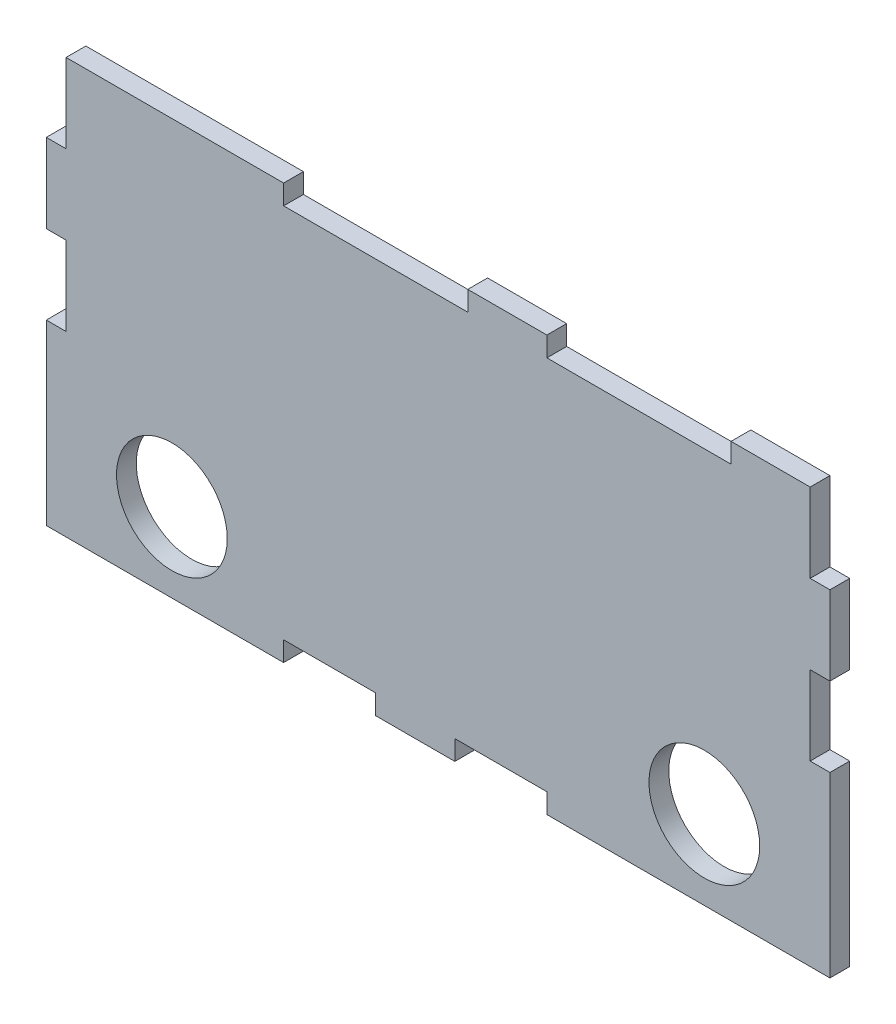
ISO-10303-21;
HEADER;
FILE_DESCRIPTION(('STEP AP214'),'2;1');
FILE_NAME('part.step','',(''),(''),'','','');
FILE_SCHEMA(('AUTOMOTIVE_DESIGN { 1 0 10303 214 1 1 1 1 }'));
ENDSEC;
DATA;
#1=APPLICATION_CONTEXT('core data for automotive mechanical design processes');
#2=APPLICATION_PROTOCOL_DEFINITION('international standard','automotive_design',2000,#1);
#3=PRODUCT_CONTEXT('',#1,'mechanical');
#4=PRODUCT('Part','Part','',(#3));
#5=PRODUCT_RELATED_PRODUCT_CATEGORY('part','',(#4));
#6=PRODUCT_DEFINITION_FORMATION('','',#4);
#7=PRODUCT_DEFINITION_CONTEXT('part definition',#1,'design');
#8=PRODUCT_DEFINITION('design','',#6,#7);
#9=PRODUCT_DEFINITION_SHAPE('','',#8);
#10=(LENGTH_UNIT() NAMED_UNIT(*) SI_UNIT(.MILLI.,.METRE.));
#11=(NAMED_UNIT(*) PLANE_ANGLE_UNIT() SI_UNIT($,.RADIAN.));
#12=(NAMED_UNIT(*) SI_UNIT($,.STERADIAN.) SOLID_ANGLE_UNIT());
#13=UNCERTAINTY_MEASURE_WITH_UNIT(LENGTH_MEASURE(1.E-05),#10,'distance_accuracy_value','');
#14=(GEOMETRIC_REPRESENTATION_CONTEXT(3) GLOBAL_UNCERTAINTY_ASSIGNED_CONTEXT((#13)) GLOBAL_UNIT_ASSIGNED_CONTEXT((#10,
#11,#12)) REPRESENTATION_CONTEXT('',''));
#15=CARTESIAN_POINT('',(0.,0.,0.));
#16=DIRECTION('',(0.,0.,1.));
#17=DIRECTION('',(1.,0.,0.));
#18=AXIS2_PLACEMENT_3D('',#15,#16,#17);
#19=CARTESIAN_POINT('',(0.,0.,5.));
#20=DIRECTION('',(0.,0.,1.));
#21=DIRECTION('',(1.,0.,0.));
#22=AXIS2_PLACEMENT_3D('',#19,#20,#21);
#23=PLANE('',#22);
#24=CARTESIAN_POINT('',(31.75,20.,5.));
#25=DIRECTION('',(0.,0.,1.));
#26=DIRECTION('',(1.,0.,0.));
#27=AXIS2_PLACEMENT_3D('',#24,#25,#26);
#28=CIRCLE('',#27,14.);
#29=CARTESIAN_POINT('',(45.75,20.,5.));
#30=VERTEX_POINT('',#29);
#31=EDGE_CURVE('E284',#30,#30,#28,.T.);
#32=ORIENTED_EDGE('',*,*,#31,.F.);
#33=EDGE_LOOP('',(#32));
#34=FACE_BOUND('',#33,.T.);
#35=DIRECTION('',(1.,0.,0.));
#36=VECTOR('',#35,1.);
#37=CARTESIAN_POINT('',(0.,0.,5.));
#38=LINE('',#37,#36);
#39=CARTESIAN_POINT('',(0.,0.,5.));
#40=VERTEX_POINT('',#39);
#41=CARTESIAN_POINT('',(60.,0.,5.));
#42=VERTEX_POINT('',#41);
#43=EDGE_CURVE('E343',#40,#42,#38,.T.);
#44=ORIENTED_EDGE('',*,*,#43,.T.);
#45=DIRECTION('',(0.,1.,0.));
#46=VECTOR('',#45,1.);
#47=CARTESIAN_POINT('',(60.,0.,5.));
#48=LINE('',#47,#46);
#49=CARTESIAN_POINT('',(60.,5.,5.));
#50=VERTEX_POINT('',#49);
#51=EDGE_CURVE('E171',#42,#50,#48,.T.);
#52=ORIENTED_EDGE('',*,*,#51,.T.);
#53=DIRECTION('',(1.,0.,0.));
#54=VECTOR('',#53,1.);
#55=CARTESIAN_POINT('',(60.,5.,5.));
#56=LINE('',#55,#54);
#57=CARTESIAN_POINT('',(83.28,5.,5.));
#58=VERTEX_POINT('',#57);
#59=EDGE_CURVE('E430',#50,#58,#56,.T.);
#60=ORIENTED_EDGE('',*,*,#59,.T.);
#61=DIRECTION('',(0.,-1.,0.));
#62=VECTOR('',#61,1.);
#63=CARTESIAN_POINT('',(83.28,5.,5.));
#64=LINE('',#63,#62);
#65=CARTESIAN_POINT('',(83.28,0.,5.));
#66=VERTEX_POINT('',#65);
#67=EDGE_CURVE('E449',#58,#66,#64,.T.);
#68=ORIENTED_EDGE('',*,*,#67,.T.);
#69=DIRECTION('',(1.,0.,0.));
#70=VECTOR('',#69,1.);
#71=CARTESIAN_POINT('',(83.28,0.,5.));
#72=LINE('',#71,#70);
#73=CARTESIAN_POINT('',(103.28,0.,5.));
#74=VERTEX_POINT('',#73);
#75=EDGE_CURVE('E446',#66,#74,#72,.T.);
#76=ORIENTED_EDGE('',*,*,#75,.T.);
#77=DIRECTION('',(0.,1.,0.));
#78=VECTOR('',#77,1.);
#79=CARTESIAN_POINT('',(103.28,0.,5.));
#80=LINE('',#79,#78);
#81=CARTESIAN_POINT('',(103.28,5.,5.));
#82=VERTEX_POINT('',#81);
#83=EDGE_CURVE('E448',#74,#82,#80,.T.);
#84=ORIENTED_EDGE('',*,*,#83,.T.);
#85=DIRECTION('',(1.,0.,0.));
#86=VECTOR('',#85,1.);
#87=CARTESIAN_POINT('',(103.28,5.,5.));
#88=LINE('',#87,#86);
#89=CARTESIAN_POINT('',(126.56,5.,5.));
#90=VERTEX_POINT('',#89);
#91=EDGE_CURVE('E451',#82,#90,#88,.T.);
#92=ORIENTED_EDGE('',*,*,#91,.T.);
#93=DIRECTION('',(0.,-1.,0.));
#94=VECTOR('',#93,1.);
#95=CARTESIAN_POINT('',(126.56,5.,5.));
#96=LINE('',#95,#94);
#97=CARTESIAN_POINT('',(126.56,0.,5.));
#98=VERTEX_POINT('',#97);
#99=EDGE_CURVE('E457',#90,#98,#96,.T.);
#100=ORIENTED_EDGE('',*,*,#99,.T.);
#101=DIRECTION('',(1.,0.,0.));
#102=VECTOR('',#101,1.);
#103=CARTESIAN_POINT('',(126.56,0.,5.));
#104=LINE('',#103,#102);
#105=CARTESIAN_POINT('',(198.12,0.,5.));
#106=VERTEX_POINT('',#105);
#107=EDGE_CURVE('E459',#98,#106,#104,.T.);
#108=ORIENTED_EDGE('',*,*,#107,.T.);
#109=DIRECTION('',(0.,1.,0.));
#110=VECTOR('',#109,1.);
#111=CARTESIAN_POINT('',(198.12,45.,5.));
#112=LINE('',#111,#110);
#113=CARTESIAN_POINT('',(198.12,45.,5.));
#114=VERTEX_POINT('',#113);
#115=EDGE_CURVE('E461',#106,#114,#112,.T.);
#116=ORIENTED_EDGE('',*,*,#115,.T.);
#117=DIRECTION('',(-1.,0.,0.));
#118=VECTOR('',#117,1.);
#119=CARTESIAN_POINT('',(193.12,45.,5.));
#120=LINE('',#119,#118);
#121=CARTESIAN_POINT('',(193.12,45.,5.));
#122=VERTEX_POINT('',#121);
#123=EDGE_CURVE('E463',#114,#122,#120,.T.);
#124=ORIENTED_EDGE('',*,*,#123,.T.);
#125=DIRECTION('',(0.,1.,0.));
#126=VECTOR('',#125,1.);
#127=CARTESIAN_POINT('',(193.12,65.,5.));
#128=LINE('',#127,#126);
#129=CARTESIAN_POINT('',(193.12,65.,5.));
#130=VERTEX_POINT('',#129);
#131=EDGE_CURVE('E465',#122,#130,#128,.T.);
#132=ORIENTED_EDGE('',*,*,#131,.T.);
#133=DIRECTION('',(1.,0.,0.));
#134=VECTOR('',#133,1.);
#135=CARTESIAN_POINT('',(198.12,65.,5.));
#136=LINE('',#135,#134);
#137=CARTESIAN_POINT('',(198.12,65.,5.));
#138=VERTEX_POINT('',#137);
#139=EDGE_CURVE('E467',#130,#138,#136,.T.);
#140=ORIENTED_EDGE('',*,*,#139,.T.);
#141=DIRECTION('',(0.,1.,0.));
#142=VECTOR('',#141,1.);
#143=CARTESIAN_POINT('',(198.12,85.,5.));
#144=LINE('',#143,#142);
#145=CARTESIAN_POINT('',(198.12,85.,5.));
#146=VERTEX_POINT('',#145);
#147=EDGE_CURVE('E469',#138,#146,#144,.T.);
#148=ORIENTED_EDGE('',*,*,#147,.T.);
#149=DIRECTION('',(-1.,0.,0.));
#150=VECTOR('',#149,1.);
#151=CARTESIAN_POINT('',(193.12,85.,5.));
#152=LINE('',#151,#150);
#153=CARTESIAN_POINT('',(193.12,85.,5.));
#154=VERTEX_POINT('',#153);
#155=EDGE_CURVE('E471',#146,#154,#152,.T.);
#156=ORIENTED_EDGE('',*,*,#155,.T.);
#157=DIRECTION('',(0.,1.,0.));
#158=VECTOR('',#157,1.);
#159=CARTESIAN_POINT('',(193.12,105.,5.));
#160=LINE('',#159,#158);
#161=CARTESIAN_POINT('',(193.12,105.,5.));
#162=VERTEX_POINT('',#161);
#163=EDGE_CURVE('E473',#154,#162,#160,.T.);
#164=ORIENTED_EDGE('',*,*,#163,.T.);
#165=DIRECTION('',(-1.,0.,0.));
#166=VECTOR('',#165,1.);
#167=CARTESIAN_POINT('',(173.12,105.,5.));
#168=LINE('',#167,#166);
#169=CARTESIAN_POINT('',(173.12,105.,5.));
#170=VERTEX_POINT('',#169);
#171=EDGE_CURVE('E475',#162,#170,#168,.T.);
#172=ORIENTED_EDGE('',*,*,#171,.T.);
#173=DIRECTION('',(0.,-1.,0.));
#174=VECTOR('',#173,1.);
#175=CARTESIAN_POINT('',(173.12,100.,5.));
#176=LINE('',#175,#174);
#177=CARTESIAN_POINT('',(173.12,100.,5.));
#178=VERTEX_POINT('',#177);
#179=EDGE_CURVE('E477',#170,#178,#176,.T.);
#180=ORIENTED_EDGE('',*,*,#179,.T.);
#181=DIRECTION('',(-1.,0.,0.));
#182=VECTOR('',#181,1.);
#183=CARTESIAN_POINT('',(126.56,100.,5.));
#184=LINE('',#183,#182);
#185=CARTESIAN_POINT('',(126.56,100.,5.));
#186=VERTEX_POINT('',#185);
#187=EDGE_CURVE('E479',#178,#186,#184,.T.);
#188=ORIENTED_EDGE('',*,*,#187,.T.);
#189=DIRECTION('',(0.,1.,0.));
#190=VECTOR('',#189,1.);
#191=CARTESIAN_POINT('',(126.56,105.,5.));
#192=LINE('',#191,#190);
#193=CARTESIAN_POINT('',(126.56,105.,5.));
#194=VERTEX_POINT('',#193);
#195=EDGE_CURVE('E481',#186,#194,#192,.T.);
#196=ORIENTED_EDGE('',*,*,#195,.T.);
#197=DIRECTION('',(-1.,0.,0.));
#198=VECTOR('',#197,1.);
#199=CARTESIAN_POINT('',(106.56,105.,5.));
#200=LINE('',#199,#198);
#201=CARTESIAN_POINT('',(106.56,105.,5.));
#202=VERTEX_POINT('',#201);
#203=EDGE_CURVE('E483',#194,#202,#200,.T.);
#204=ORIENTED_EDGE('',*,*,#203,.T.);
#205=DIRECTION('',(0.,-1.,0.));
#206=VECTOR('',#205,1.);
#207=CARTESIAN_POINT('',(106.56,100.,5.));
#208=LINE('',#207,#206);
#209=CARTESIAN_POINT('',(106.56,100.,5.));
#210=VERTEX_POINT('',#209);
#211=EDGE_CURVE('E485',#202,#210,#208,.T.);
#212=ORIENTED_EDGE('',*,*,#211,.T.);
#213=DIRECTION('',(-1.,0.,0.));
#214=VECTOR('',#213,1.);
#215=CARTESIAN_POINT('',(60.,100.,5.));
#216=LINE('',#215,#214);
#217=CARTESIAN_POINT('',(60.,100.,5.));
#218=VERTEX_POINT('',#217);
#219=EDGE_CURVE('E487',#210,#218,#216,.T.);
#220=ORIENTED_EDGE('',*,*,#219,.T.);
#221=DIRECTION('',(0.,1.,0.));
#222=VECTOR('',#221,1.);
#223=CARTESIAN_POINT('',(60.,105.,5.));
#224=LINE('',#223,#222);
#225=CARTESIAN_POINT('',(60.,105.,5.));
#226=VERTEX_POINT('',#225);
#227=EDGE_CURVE('E489',#218,#226,#224,.T.);
#228=ORIENTED_EDGE('',*,*,#227,.T.);
#229=DIRECTION('',(-1.,0.,0.));
#230=VECTOR('',#229,1.);
#231=CARTESIAN_POINT('',(5.,105.,5.));
#232=LINE('',#231,#230);
#233=CARTESIAN_POINT('',(5.,105.,5.));
#234=VERTEX_POINT('',#233);
#235=EDGE_CURVE('E491',#226,#234,#232,.T.);
#236=ORIENTED_EDGE('',*,*,#235,.T.);
#237=DIRECTION('',(0.,-1.,0.));
#238=VECTOR('',#237,1.);
#239=CARTESIAN_POINT('',(5.,85.,5.));
#240=LINE('',#239,#238);
#241=CARTESIAN_POINT('',(5.,85.,5.));
#242=VERTEX_POINT('',#241);
#243=EDGE_CURVE('E493',#234,#242,#240,.T.);
#244=ORIENTED_EDGE('',*,*,#243,.T.);
#245=DIRECTION('',(-1.,0.,0.));
#246=VECTOR('',#245,1.);
#247=CARTESIAN_POINT('',(0.,85.,5.));
#248=LINE('',#247,#246);
#249=CARTESIAN_POINT('',(0.,85.,5.));
#250=VERTEX_POINT('',#249);
#251=EDGE_CURVE('E495',#242,#250,#248,.T.);
#252=ORIENTED_EDGE('',*,*,#251,.T.);
#253=DIRECTION('',(0.,-1.,0.));
#254=VECTOR('',#253,1.);
#255=CARTESIAN_POINT('',(0.,65.,5.));
#256=LINE('',#255,#254);
#257=CARTESIAN_POINT('',(0.,65.,5.));
#258=VERTEX_POINT('',#257);
#259=EDGE_CURVE('E497',#250,#258,#256,.T.);
#260=ORIENTED_EDGE('',*,*,#259,.T.);
#261=DIRECTION('',(1.,0.,0.));
#262=VECTOR('',#261,1.);
#263=CARTESIAN_POINT('',(5.,65.,5.));
#264=LINE('',#263,#262);
#265=CARTESIAN_POINT('',(5.,65.,5.));
#266=VERTEX_POINT('',#265);
#267=EDGE_CURVE('E262',#258,#266,#264,.T.);
#268=ORIENTED_EDGE('',*,*,#267,.T.);
#269=DIRECTION('',(0.,-1.,0.));
#270=VECTOR('',#269,1.);
#271=CARTESIAN_POINT('',(5.,45.,5.));
#272=LINE('',#271,#270);
#273=CARTESIAN_POINT('',(5.,45.,5.));
#274=VERTEX_POINT('',#273);
#275=EDGE_CURVE('E256',#266,#274,#272,.T.);
#276=ORIENTED_EDGE('',*,*,#275,.T.);
#277=DIRECTION('',(-1.,0.,0.));
#278=VECTOR('',#277,1.);
#279=CARTESIAN_POINT('',(0.,45.,5.));
#280=LINE('',#279,#278);
#281=CARTESIAN_POINT('',(0.,45.,5.));
#282=VERTEX_POINT('',#281);
#283=EDGE_CURVE('E260',#274,#282,#280,.T.);
#284=ORIENTED_EDGE('',*,*,#283,.T.);
#285=DIRECTION('',(0.,-1.,0.));
#286=VECTOR('',#285,1.);
#287=CARTESIAN_POINT('',(0.,0.,5.));
#288=LINE('',#287,#286);
#289=EDGE_CURVE('E56',#282,#40,#288,.T.);
#290=ORIENTED_EDGE('',*,*,#289,.T.);
#291=EDGE_LOOP('',(#44,#52,#60,#68,#76,#84,#92,#100,#108,#116,#124,#132,#140,#148,#156,#164,
#172,#180,#188,#196,#204,#212,#220,#228,#236,#244,#252,#260,#268,#276,#284,#290));
#292=FACE_BOUND('',#291,.T.);
#293=CARTESIAN_POINT('',(166.37,20.,5.));
#294=DIRECTION('',(0.,0.,1.));
#295=DIRECTION('',(1.,0.,0.));
#296=AXIS2_PLACEMENT_3D('',#293,#294,#295);
#297=CIRCLE('',#296,14.);
#298=CARTESIAN_POINT('',(180.37,20.,5.));
#299=VERTEX_POINT('',#298);
#300=EDGE_CURVE('E539',#299,#299,#297,.T.);
#301=ORIENTED_EDGE('',*,*,#300,.F.);
#302=EDGE_LOOP('',(#301));
#303=FACE_BOUND('',#302,.T.);
#304=ADVANCED_FACE('F39',(#34,#292,#303),#23,.T.);
#305=CARTESIAN_POINT('',(0.,0.,0.));
#306=DIRECTION('',(0.,0.,1.));
#307=DIRECTION('',(1.,0.,0.));
#308=AXIS2_PLACEMENT_3D('',#305,#306,#307);
#309=PLANE('',#308);
#310=DIRECTION('',(1.,0.,0.));
#311=VECTOR('',#310,1.);
#312=CARTESIAN_POINT('',(0.,0.,0.));
#313=LINE('',#312,#311);
#314=CARTESIAN_POINT('',(0.,0.,0.));
#315=VERTEX_POINT('',#314);
#316=CARTESIAN_POINT('',(60.,0.,0.));
#317=VERTEX_POINT('',#316);
#318=EDGE_CURVE('E280',#315,#317,#313,.T.);
#319=ORIENTED_EDGE('',*,*,#318,.F.);
#320=DIRECTION('',(0.,-1.,0.));
#321=VECTOR('',#320,1.);
#322=CARTESIAN_POINT('',(0.,0.,0.));
#323=LINE('',#322,#321);
#324=CARTESIAN_POINT('',(0.,45.,0.));
#325=VERTEX_POINT('',#324);
#326=EDGE_CURVE('E163',#325,#315,#323,.T.);
#327=ORIENTED_EDGE('',*,*,#326,.F.);
#328=DIRECTION('',(-1.,0.,0.));
#329=VECTOR('',#328,1.);
#330=CARTESIAN_POINT('',(0.,45.,0.));
#331=LINE('',#330,#329);
#332=CARTESIAN_POINT('',(5.,45.,0.));
#333=VERTEX_POINT('',#332);
#334=EDGE_CURVE('E157',#333,#325,#331,.T.);
#335=ORIENTED_EDGE('',*,*,#334,.F.);
#336=DIRECTION('',(0.,-1.,0.));
#337=VECTOR('',#336,1.);
#338=CARTESIAN_POINT('',(5.,45.,0.));
#339=LINE('',#338,#337);
#340=CARTESIAN_POINT('',(5.,65.,0.));
#341=VERTEX_POINT('',#340);
#342=EDGE_CURVE('E270',#341,#333,#339,.T.);
#343=ORIENTED_EDGE('',*,*,#342,.F.);
#344=DIRECTION('',(1.,0.,0.));
#345=VECTOR('',#344,1.);
#346=CARTESIAN_POINT('',(5.,65.,0.));
#347=LINE('',#346,#345);
#348=CARTESIAN_POINT('',(0.,65.,0.));
#349=VERTEX_POINT('',#348);
#350=EDGE_CURVE('E338',#349,#341,#347,.T.);
#351=ORIENTED_EDGE('',*,*,#350,.F.);
#352=DIRECTION('',(0.,-1.,0.));
#353=VECTOR('',#352,1.);
#354=CARTESIAN_POINT('',(0.,65.,0.));
#355=LINE('',#354,#353);
#356=CARTESIAN_POINT('',(0.,85.,0.));
#357=VERTEX_POINT('',#356);
#358=EDGE_CURVE('E336',#357,#349,#355,.T.);
#359=ORIENTED_EDGE('',*,*,#358,.F.);
#360=DIRECTION('',(-1.,0.,0.));
#361=VECTOR('',#360,1.);
#362=CARTESIAN_POINT('',(0.,85.,0.));
#363=LINE('',#362,#361);
#364=CARTESIAN_POINT('',(5.,85.,0.));
#365=VERTEX_POINT('',#364);
#366=EDGE_CURVE('E334',#365,#357,#363,.T.);
#367=ORIENTED_EDGE('',*,*,#366,.F.);
#368=DIRECTION('',(0.,-1.,0.));
#369=VECTOR('',#368,1.);
#370=CARTESIAN_POINT('',(5.,85.,0.));
#371=LINE('',#370,#369);
#372=CARTESIAN_POINT('',(5.,105.,0.));
#373=VERTEX_POINT('',#372);
#374=EDGE_CURVE('E332',#373,#365,#371,.T.);
#375=ORIENTED_EDGE('',*,*,#374,.F.);
#376=DIRECTION('',(-1.,0.,0.));
#377=VECTOR('',#376,1.);
#378=CARTESIAN_POINT('',(5.,105.,0.));
#379=LINE('',#378,#377);
#380=CARTESIAN_POINT('',(60.,105.,0.));
#381=VERTEX_POINT('',#380);
#382=EDGE_CURVE('E330',#381,#373,#379,.T.);
#383=ORIENTED_EDGE('',*,*,#382,.F.);
#384=DIRECTION('',(0.,1.,0.));
#385=VECTOR('',#384,1.);
#386=CARTESIAN_POINT('',(60.,105.,0.));
#387=LINE('',#386,#385);
#388=CARTESIAN_POINT('',(60.,100.,0.));
#389=VERTEX_POINT('',#388);
#390=EDGE_CURVE('E328',#389,#381,#387,.T.);
#391=ORIENTED_EDGE('',*,*,#390,.F.);
#392=DIRECTION('',(-1.,0.,0.));
#393=VECTOR('',#392,1.);
#394=CARTESIAN_POINT('',(60.,100.,0.));
#395=LINE('',#394,#393);
#396=CARTESIAN_POINT('',(106.56,100.,0.));
#397=VERTEX_POINT('',#396);
#398=EDGE_CURVE('E326',#397,#389,#395,.T.);
#399=ORIENTED_EDGE('',*,*,#398,.F.);
#400=DIRECTION('',(0.,-1.,0.));
#401=VECTOR('',#400,1.);
#402=CARTESIAN_POINT('',(106.56,100.,0.));
#403=LINE('',#402,#401);
#404=CARTESIAN_POINT('',(106.56,105.,0.));
#405=VERTEX_POINT('',#404);
#406=EDGE_CURVE('E324',#405,#397,#403,.T.);
#407=ORIENTED_EDGE('',*,*,#406,.F.);
#408=DIRECTION('',(-1.,0.,0.));
#409=VECTOR('',#408,1.);
#410=CARTESIAN_POINT('',(106.56,105.,0.));
#411=LINE('',#410,#409);
#412=CARTESIAN_POINT('',(126.56,105.,0.));
#413=VERTEX_POINT('',#412);
#414=EDGE_CURVE('E322',#413,#405,#411,.T.);
#415=ORIENTED_EDGE('',*,*,#414,.F.);
#416=DIRECTION('',(0.,1.,0.));
#417=VECTOR('',#416,1.);
#418=CARTESIAN_POINT('',(126.56,105.,0.));
#419=LINE('',#418,#417);
#420=CARTESIAN_POINT('',(126.56,100.,0.));
#421=VERTEX_POINT('',#420);
#422=EDGE_CURVE('E320',#421,#413,#419,.T.);
#423=ORIENTED_EDGE('',*,*,#422,.F.);
#424=DIRECTION('',(-1.,0.,0.));
#425=VECTOR('',#424,1.);
#426=CARTESIAN_POINT('',(126.56,100.,0.));
#427=LINE('',#426,#425);
#428=CARTESIAN_POINT('',(173.12,100.,0.));
#429=VERTEX_POINT('',#428);
#430=EDGE_CURVE('E318',#429,#421,#427,.T.);
#431=ORIENTED_EDGE('',*,*,#430,.F.);
#432=DIRECTION('',(0.,-1.,0.));
#433=VECTOR('',#432,1.);
#434=CARTESIAN_POINT('',(173.12,100.,0.));
#435=LINE('',#434,#433);
#436=CARTESIAN_POINT('',(173.12,105.,0.));
#437=VERTEX_POINT('',#436);
#438=EDGE_CURVE('E316',#437,#429,#435,.T.);
#439=ORIENTED_EDGE('',*,*,#438,.F.);
#440=DIRECTION('',(-1.,0.,0.));
#441=VECTOR('',#440,1.);
#442=CARTESIAN_POINT('',(173.12,105.,0.));
#443=LINE('',#442,#441);
#444=CARTESIAN_POINT('',(193.12,105.,0.));
#445=VERTEX_POINT('',#444);
#446=EDGE_CURVE('E314',#445,#437,#443,.T.);
#447=ORIENTED_EDGE('',*,*,#446,.F.);
#448=DIRECTION('',(0.,1.,0.));
#449=VECTOR('',#448,1.);
#450=CARTESIAN_POINT('',(193.12,105.,0.));
#451=LINE('',#450,#449);
#452=CARTESIAN_POINT('',(193.12,85.,0.));
#453=VERTEX_POINT('',#452);
#454=EDGE_CURVE('E312',#453,#445,#451,.T.);
#455=ORIENTED_EDGE('',*,*,#454,.F.);
#456=DIRECTION('',(-1.,0.,0.));
#457=VECTOR('',#456,1.);
#458=CARTESIAN_POINT('',(193.12,85.,0.));
#459=LINE('',#458,#457);
#460=CARTESIAN_POINT('',(198.12,85.,0.));
#461=VERTEX_POINT('',#460);
#462=EDGE_CURVE('E310',#461,#453,#459,.T.);
#463=ORIENTED_EDGE('',*,*,#462,.F.);
#464=DIRECTION('',(0.,1.,0.));
#465=VECTOR('',#464,1.);
#466=CARTESIAN_POINT('',(198.12,85.,0.));
#467=LINE('',#466,#465);
#468=CARTESIAN_POINT('',(198.12,65.,0.));
#469=VERTEX_POINT('',#468);
#470=EDGE_CURVE('E308',#469,#461,#467,.T.);
#471=ORIENTED_EDGE('',*,*,#470,.F.);
#472=DIRECTION('',(1.,0.,0.));
#473=VECTOR('',#472,1.);
#474=CARTESIAN_POINT('',(198.12,65.,0.));
#475=LINE('',#474,#473);
#476=CARTESIAN_POINT('',(193.12,65.,0.));
#477=VERTEX_POINT('',#476);
#478=EDGE_CURVE('E306',#477,#469,#475,.T.);
#479=ORIENTED_EDGE('',*,*,#478,.F.);
#480=DIRECTION('',(0.,1.,0.));
#481=VECTOR('',#480,1.);
#482=CARTESIAN_POINT('',(193.12,65.,0.));
#483=LINE('',#482,#481);
#484=CARTESIAN_POINT('',(193.12,45.,0.));
#485=VERTEX_POINT('',#484);
#486=EDGE_CURVE('E304',#485,#477,#483,.T.);
#487=ORIENTED_EDGE('',*,*,#486,.F.);
#488=DIRECTION('',(-1.,0.,0.));
#489=VECTOR('',#488,1.);
#490=CARTESIAN_POINT('',(193.12,45.,0.));
#491=LINE('',#490,#489);
#492=CARTESIAN_POINT('',(198.12,45.,0.));
#493=VERTEX_POINT('',#492);
#494=EDGE_CURVE('E302',#493,#485,#491,.T.);
#495=ORIENTED_EDGE('',*,*,#494,.F.);
#496=DIRECTION('',(0.,1.,0.));
#497=VECTOR('',#496,1.);
#498=CARTESIAN_POINT('',(198.12,45.,0.));
#499=LINE('',#498,#497);
#500=CARTESIAN_POINT('',(198.12,0.,0.));
#501=VERTEX_POINT('',#500);
#502=EDGE_CURVE('E300',#501,#493,#499,.T.);
#503=ORIENTED_EDGE('',*,*,#502,.F.);
#504=DIRECTION('',(1.,0.,0.));
#505=VECTOR('',#504,1.);
#506=CARTESIAN_POINT('',(126.56,0.,0.));
#507=LINE('',#506,#505);
#508=CARTESIAN_POINT('',(126.56,0.,0.));
#509=VERTEX_POINT('',#508);
#510=EDGE_CURVE('E298',#509,#501,#507,.T.);
#511=ORIENTED_EDGE('',*,*,#510,.F.);
#512=DIRECTION('',(0.,-1.,0.));
#513=VECTOR('',#512,1.);
#514=CARTESIAN_POINT('',(126.56,5.,0.));
#515=LINE('',#514,#513);
#516=CARTESIAN_POINT('',(126.56,5.,0.));
#517=VERTEX_POINT('',#516);
#518=EDGE_CURVE('E296',#517,#509,#515,.T.);
#519=ORIENTED_EDGE('',*,*,#518,.F.);
#520=DIRECTION('',(1.,0.,0.));
#521=VECTOR('',#520,1.);
#522=CARTESIAN_POINT('',(103.28,5.,0.));
#523=LINE('',#522,#521);
#524=CARTESIAN_POINT('',(103.28,5.,0.));
#525=VERTEX_POINT('',#524);
#526=EDGE_CURVE('E294',#525,#517,#523,.T.);
#527=ORIENTED_EDGE('',*,*,#526,.F.);
#528=DIRECTION('',(0.,1.,0.));
#529=VECTOR('',#528,1.);
#530=CARTESIAN_POINT('',(103.28,0.,0.));
#531=LINE('',#530,#529);
#532=CARTESIAN_POINT('',(103.28,0.,0.));
#533=VERTEX_POINT('',#532);
#534=EDGE_CURVE('E292',#533,#525,#531,.T.);
#535=ORIENTED_EDGE('',*,*,#534,.F.);
#536=DIRECTION('',(1.,0.,0.));
#537=VECTOR('',#536,1.);
#538=CARTESIAN_POINT('',(83.28,0.,0.));
#539=LINE('',#538,#537);
#540=CARTESIAN_POINT('',(83.28,0.,0.));
#541=VERTEX_POINT('',#540);
#542=EDGE_CURVE('E290',#541,#533,#539,.T.);
#543=ORIENTED_EDGE('',*,*,#542,.F.);
#544=DIRECTION('',(0.,-1.,0.));
#545=VECTOR('',#544,1.);
#546=CARTESIAN_POINT('',(83.28,5.,0.));
#547=LINE('',#546,#545);
#548=CARTESIAN_POINT('',(83.28,5.,0.));
#549=VERTEX_POINT('',#548);
#550=EDGE_CURVE('E288',#549,#541,#547,.T.);
#551=ORIENTED_EDGE('',*,*,#550,.F.);
#552=DIRECTION('',(1.,0.,0.));
#553=VECTOR('',#552,1.);
#554=CARTESIAN_POINT('',(60.,5.,0.));
#555=LINE('',#554,#553);
#556=CARTESIAN_POINT('',(60.,5.,0.));
#557=VERTEX_POINT('',#556);
#558=EDGE_CURVE('E286',#557,#549,#555,.T.);
#559=ORIENTED_EDGE('',*,*,#558,.F.);
#560=DIRECTION('',(0.,1.,0.));
#561=VECTOR('',#560,1.);
#562=CARTESIAN_POINT('',(60.,0.,0.));
#563=LINE('',#562,#561);
#564=EDGE_CURVE('E283',#317,#557,#563,.T.);
#565=ORIENTED_EDGE('',*,*,#564,.F.);
#566=EDGE_LOOP('',(#319,#327,#335,#343,#351,#359,#367,#375,#383,#391,#399,#407,#415,#423,#431,
#439,#447,#455,#463,#471,#479,#487,#495,#503,#511,#519,#527,#535,#543,#551,#559,#565));
#567=FACE_BOUND('',#566,.T.);
#568=CARTESIAN_POINT('',(31.75,20.,0.));
#569=DIRECTION('',(0.,0.,1.));
#570=DIRECTION('',(1.,0.,0.));
#571=AXIS2_PLACEMENT_3D('',#568,#569,#570);
#572=CIRCLE('',#571,14.);
#573=CARTESIAN_POINT('',(45.75,20.,0.));
#574=VERTEX_POINT('',#573);
#575=EDGE_CURVE('E545',#574,#574,#572,.T.);
#576=ORIENTED_EDGE('',*,*,#575,.T.);
#577=EDGE_LOOP('',(#576));
#578=FACE_BOUND('',#577,.T.);
#579=CARTESIAN_POINT('',(166.37,20.,0.));
#580=DIRECTION('',(0.,0.,1.));
#581=DIRECTION('',(1.,0.,0.));
#582=AXIS2_PLACEMENT_3D('',#579,#580,#581);
#583=CIRCLE('',#582,14.);
#584=CARTESIAN_POINT('',(180.37,20.,0.));
#585=VERTEX_POINT('',#584);
#586=EDGE_CURVE('E542',#585,#585,#583,.T.);
#587=ORIENTED_EDGE('',*,*,#586,.T.);
#588=EDGE_LOOP('',(#587));
#589=FACE_BOUND('',#588,.T.);
#590=ADVANCED_FACE('F434',(#567,#578,#589),#309,.F.);
#591=CARTESIAN_POINT('',(0.,0.,5.));
#592=DIRECTION('',(0.,1.,0.));
#593=DIRECTION('',(0.,0.,1.));
#594=AXIS2_PLACEMENT_3D('',#591,#592,#593);
#595=PLANE('',#594);
#596=ORIENTED_EDGE('',*,*,#318,.T.);
#597=DIRECTION('',(0.,0.,-1.));
#598=VECTOR('',#597,1.);
#599=CARTESIAN_POINT('',(60.,0.,5.));
#600=LINE('',#599,#598);
#601=EDGE_CURVE('E11',#42,#317,#600,.T.);
#602=ORIENTED_EDGE('',*,*,#601,.F.);
#603=ORIENTED_EDGE('',*,*,#43,.F.);
#604=DIRECTION('',(0.,0.,-1.));
#605=VECTOR('',#604,1.);
#606=CARTESIAN_POINT('',(0.,0.,5.));
#607=LINE('',#606,#605);
#608=EDGE_CURVE('E276',#40,#315,#607,.T.);
#609=ORIENTED_EDGE('',*,*,#608,.T.);
#610=EDGE_LOOP('',(#596,#602,#603,#609));
#611=FACE_BOUND('',#610,.T.);
#612=ADVANCED_FACE('F41',(#611),#595,.F.);
#613=CARTESIAN_POINT('',(60.,0.,5.));
#614=DIRECTION('',(-1.,0.,0.));
#615=DIRECTION('',(0.,0.,1.));
#616=AXIS2_PLACEMENT_3D('',#613,#614,#615);
#617=PLANE('',#616);
#618=ORIENTED_EDGE('',*,*,#564,.T.);
#619=DIRECTION('',(0.,0.,-1.));
#620=VECTOR('',#619,1.);
#621=CARTESIAN_POINT('',(60.,5.,5.));
#622=LINE('',#621,#620);
#623=EDGE_CURVE('E48',#50,#557,#622,.T.);
#624=ORIENTED_EDGE('',*,*,#623,.F.);
#625=ORIENTED_EDGE('',*,*,#51,.F.);
#626=ORIENTED_EDGE('',*,*,#601,.T.);
#627=EDGE_LOOP('',(#618,#624,#625,#626));
#628=FACE_BOUND('',#627,.T.);
#629=ADVANCED_FACE('F868',(#628),#617,.F.);
#630=CARTESIAN_POINT('',(60.,5.,5.));
#631=DIRECTION('',(0.,1.,0.));
#632=DIRECTION('',(0.,0.,1.));
#633=AXIS2_PLACEMENT_3D('',#630,#631,#632);
#634=PLANE('',#633);
#635=ORIENTED_EDGE('',*,*,#558,.T.);
#636=DIRECTION('',(0.,0.,-1.));
#637=VECTOR('',#636,1.);
#638=CARTESIAN_POINT('',(83.28,5.,5.));
#639=LINE('',#638,#637);
#640=EDGE_CURVE('E422',#58,#549,#639,.T.);
#641=ORIENTED_EDGE('',*,*,#640,.F.);
#642=ORIENTED_EDGE('',*,*,#59,.F.);
#643=ORIENTED_EDGE('',*,*,#623,.T.);
#644=EDGE_LOOP('',(#635,#641,#642,#643));
#645=FACE_BOUND('',#644,.T.);
#646=ADVANCED_FACE('F428',(#645),#634,.F.);
#647=CARTESIAN_POINT('',(83.28,5.,5.));
#648=DIRECTION('',(1.,0.,0.));
#649=DIRECTION('',(0.,0.,-1.));
#650=AXIS2_PLACEMENT_3D('',#647,#648,#649);
#651=PLANE('',#650);
#652=ORIENTED_EDGE('',*,*,#550,.T.);
#653=DIRECTION('',(0.,0.,-1.));
#654=VECTOR('',#653,1.);
#655=CARTESIAN_POINT('',(83.28,0.,5.));
#656=LINE('',#655,#654);
#657=EDGE_CURVE('E419',#66,#541,#656,.T.);
#658=ORIENTED_EDGE('',*,*,#657,.F.);
#659=ORIENTED_EDGE('',*,*,#67,.F.);
#660=ORIENTED_EDGE('',*,*,#640,.T.);
#661=EDGE_LOOP('',(#652,#658,#659,#660));
#662=FACE_BOUND('',#661,.T.);
#663=ADVANCED_FACE('F440',(#662),#651,.F.);
#664=CARTESIAN_POINT('',(83.28,0.,5.));
#665=DIRECTION('',(0.,1.,0.));
#666=DIRECTION('',(0.,0.,1.));
#667=AXIS2_PLACEMENT_3D('',#664,#665,#666);
#668=PLANE('',#667);
#669=ORIENTED_EDGE('',*,*,#542,.T.);
#670=DIRECTION('',(0.,0.,-1.));
#671=VECTOR('',#670,1.);
#672=CARTESIAN_POINT('',(103.28,0.,5.));
#673=LINE('',#672,#671);
#674=EDGE_CURVE('E416',#74,#533,#673,.T.);
#675=ORIENTED_EDGE('',*,*,#674,.F.);
#676=ORIENTED_EDGE('',*,*,#75,.F.);
#677=ORIENTED_EDGE('',*,*,#657,.T.);
#678=EDGE_LOOP('',(#669,#675,#676,#677));
#679=FACE_BOUND('',#678,.T.);
#680=ADVANCED_FACE('F444',(#679),#668,.F.);
#681=CARTESIAN_POINT('',(103.28,0.,5.));
#682=DIRECTION('',(-1.,0.,0.));
#683=DIRECTION('',(0.,0.,1.));
#684=AXIS2_PLACEMENT_3D('',#681,#682,#683);
#685=PLANE('',#684);
#686=ORIENTED_EDGE('',*,*,#534,.T.);
#687=DIRECTION('',(0.,0.,-1.));
#688=VECTOR('',#687,1.);
#689=CARTESIAN_POINT('',(103.28,5.,5.));
#690=LINE('',#689,#688);
#691=EDGE_CURVE('E413',#82,#525,#690,.T.);
#692=ORIENTED_EDGE('',*,*,#691,.F.);
#693=ORIENTED_EDGE('',*,*,#83,.F.);
#694=ORIENTED_EDGE('',*,*,#674,.T.);
#695=EDGE_LOOP('',(#686,#692,#693,#694));
#696=FACE_BOUND('',#695,.T.);
#697=ADVANCED_FACE('F829',(#696),#685,.F.);
#698=CARTESIAN_POINT('',(103.28,5.,5.));
#699=DIRECTION('',(0.,1.,0.));
#700=DIRECTION('',(0.,0.,1.));
#701=AXIS2_PLACEMENT_3D('',#698,#699,#700);
#702=PLANE('',#701);
#703=ORIENTED_EDGE('',*,*,#526,.T.);
#704=DIRECTION('',(0.,0.,-1.));
#705=VECTOR('',#704,1.);
#706=CARTESIAN_POINT('',(126.56,5.,5.));
#707=LINE('',#706,#705);
#708=EDGE_CURVE('E410',#90,#517,#707,.T.);
#709=ORIENTED_EDGE('',*,*,#708,.F.);
#710=ORIENTED_EDGE('',*,*,#91,.F.);
#711=ORIENTED_EDGE('',*,*,#691,.T.);
#712=EDGE_LOOP('',(#703,#709,#710,#711));
#713=FACE_BOUND('',#712,.T.);
#714=ADVANCED_FACE('F818',(#713),#702,.F.);
#715=CARTESIAN_POINT('',(126.56,5.,5.));
#716=DIRECTION('',(1.,0.,0.));
#717=DIRECTION('',(0.,0.,-1.));
#718=AXIS2_PLACEMENT_3D('',#715,#716,#717);
#719=PLANE('',#718);
#720=ORIENTED_EDGE('',*,*,#518,.T.);
#721=DIRECTION('',(0.,0.,-1.));
#722=VECTOR('',#721,1.);
#723=CARTESIAN_POINT('',(126.56,0.,5.));
#724=LINE('',#723,#722);
#725=EDGE_CURVE('E407',#98,#509,#724,.T.);
#726=ORIENTED_EDGE('',*,*,#725,.F.);
#727=ORIENTED_EDGE('',*,*,#99,.F.);
#728=ORIENTED_EDGE('',*,*,#708,.T.);
#729=EDGE_LOOP('',(#720,#726,#727,#728));
#730=FACE_BOUND('',#729,.T.);
#731=ADVANCED_FACE('F807',(#730),#719,.F.);
#732=CARTESIAN_POINT('',(126.56,0.,5.));
#733=DIRECTION('',(0.,1.,0.));
#734=DIRECTION('',(0.,0.,1.));
#735=AXIS2_PLACEMENT_3D('',#732,#733,#734);
#736=PLANE('',#735);
#737=ORIENTED_EDGE('',*,*,#510,.T.);
#738=DIRECTION('',(0.,0.,-1.));
#739=VECTOR('',#738,1.);
#740=CARTESIAN_POINT('',(198.12,0.,5.));
#741=LINE('',#740,#739);
#742=EDGE_CURVE('E404',#106,#501,#741,.T.);
#743=ORIENTED_EDGE('',*,*,#742,.F.);
#744=ORIENTED_EDGE('',*,*,#107,.F.);
#745=ORIENTED_EDGE('',*,*,#725,.T.);
#746=EDGE_LOOP('',(#737,#743,#744,#745));
#747=FACE_BOUND('',#746,.T.);
#748=ADVANCED_FACE('F796',(#747),#736,.F.);
#749=CARTESIAN_POINT('',(198.12,45.,5.));
#750=DIRECTION('',(-1.,0.,0.));
#751=DIRECTION('',(0.,0.,1.));
#752=AXIS2_PLACEMENT_3D('',#749,#750,#751);
#753=PLANE('',#752);
#754=ORIENTED_EDGE('',*,*,#502,.T.);
#755=DIRECTION('',(0.,0.,-1.));
#756=VECTOR('',#755,1.);
#757=CARTESIAN_POINT('',(198.12,45.,5.));
#758=LINE('',#757,#756);
#759=EDGE_CURVE('E401',#114,#493,#758,.T.);
#760=ORIENTED_EDGE('',*,*,#759,.F.);
#761=ORIENTED_EDGE('',*,*,#115,.F.);
#762=ORIENTED_EDGE('',*,*,#742,.T.);
#763=EDGE_LOOP('',(#754,#760,#761,#762));
#764=FACE_BOUND('',#763,.T.);
#765=ADVANCED_FACE('F785',(#764),#753,.F.);
#766=CARTESIAN_POINT('',(193.12,45.,5.));
#767=DIRECTION('',(0.,-1.,0.));
#768=DIRECTION('',(0.,0.,-1.));
#769=AXIS2_PLACEMENT_3D('',#766,#767,#768);
#770=PLANE('',#769);
#771=ORIENTED_EDGE('',*,*,#494,.T.);
#772=DIRECTION('',(0.,0.,-1.));
#773=VECTOR('',#772,1.);
#774=CARTESIAN_POINT('',(193.12,45.,5.));
#775=LINE('',#774,#773);
#776=EDGE_CURVE('E398',#122,#485,#775,.T.);
#777=ORIENTED_EDGE('',*,*,#776,.F.);
#778=ORIENTED_EDGE('',*,*,#123,.F.);
#779=ORIENTED_EDGE('',*,*,#759,.T.);
#780=EDGE_LOOP('',(#771,#777,#778,#779));
#781=FACE_BOUND('',#780,.T.);
#782=ADVANCED_FACE('F774',(#781),#770,.F.);
#783=CARTESIAN_POINT('',(193.12,65.,5.));
#784=DIRECTION('',(-1.,0.,0.));
#785=DIRECTION('',(0.,0.,1.));
#786=AXIS2_PLACEMENT_3D('',#783,#784,#785);
#787=PLANE('',#786);
#788=ORIENTED_EDGE('',*,*,#486,.T.);
#789=DIRECTION('',(0.,0.,-1.));
#790=VECTOR('',#789,1.);
#791=CARTESIAN_POINT('',(193.12,65.,5.));
#792=LINE('',#791,#790);
#793=EDGE_CURVE('E395',#130,#477,#792,.T.);
#794=ORIENTED_EDGE('',*,*,#793,.F.);
#795=ORIENTED_EDGE('',*,*,#131,.F.);
#796=ORIENTED_EDGE('',*,*,#776,.T.);
#797=EDGE_LOOP('',(#788,#794,#795,#796));
#798=FACE_BOUND('',#797,.T.);
#799=ADVANCED_FACE('F763',(#798),#787,.F.);
#800=CARTESIAN_POINT('',(198.12,65.,5.));
#801=DIRECTION('',(0.,1.,0.));
#802=DIRECTION('',(0.,0.,1.));
#803=AXIS2_PLACEMENT_3D('',#800,#801,#802);
#804=PLANE('',#803);
#805=ORIENTED_EDGE('',*,*,#478,.T.);
#806=DIRECTION('',(0.,0.,-1.));
#807=VECTOR('',#806,1.);
#808=CARTESIAN_POINT('',(198.12,65.,5.));
#809=LINE('',#808,#807);
#810=EDGE_CURVE('E392',#138,#469,#809,.T.);
#811=ORIENTED_EDGE('',*,*,#810,.F.);
#812=ORIENTED_EDGE('',*,*,#139,.F.);
#813=ORIENTED_EDGE('',*,*,#793,.T.);
#814=EDGE_LOOP('',(#805,#811,#812,#813));
#815=FACE_BOUND('',#814,.T.);
#816=ADVANCED_FACE('F752',(#815),#804,.F.);
#817=CARTESIAN_POINT('',(198.12,85.,5.));
#818=DIRECTION('',(-1.,0.,0.));
#819=DIRECTION('',(0.,0.,1.));
#820=AXIS2_PLACEMENT_3D('',#817,#818,#819);
#821=PLANE('',#820);
#822=ORIENTED_EDGE('',*,*,#470,.T.);
#823=DIRECTION('',(0.,0.,-1.));
#824=VECTOR('',#823,1.);
#825=CARTESIAN_POINT('',(198.12,85.,5.));
#826=LINE('',#825,#824);
#827=EDGE_CURVE('E389',#146,#461,#826,.T.);
#828=ORIENTED_EDGE('',*,*,#827,.F.);
#829=ORIENTED_EDGE('',*,*,#147,.F.);
#830=ORIENTED_EDGE('',*,*,#810,.T.);
#831=EDGE_LOOP('',(#822,#828,#829,#830));
#832=FACE_BOUND('',#831,.T.);
#833=ADVANCED_FACE('F741',(#832),#821,.F.);
#834=CARTESIAN_POINT('',(193.12,85.,5.));
#835=DIRECTION('',(0.,-1.,0.));
#836=DIRECTION('',(0.,0.,-1.));
#837=AXIS2_PLACEMENT_3D('',#834,#835,#836);
#838=PLANE('',#837);
#839=ORIENTED_EDGE('',*,*,#462,.T.);
#840=DIRECTION('',(0.,0.,-1.));
#841=VECTOR('',#840,1.);
#842=CARTESIAN_POINT('',(193.12,85.,5.));
#843=LINE('',#842,#841);
#844=EDGE_CURVE('E386',#154,#453,#843,.T.);
#845=ORIENTED_EDGE('',*,*,#844,.F.);
#846=ORIENTED_EDGE('',*,*,#155,.F.);
#847=ORIENTED_EDGE('',*,*,#827,.T.);
#848=EDGE_LOOP('',(#839,#845,#846,#847));
#849=FACE_BOUND('',#848,.T.);
#850=ADVANCED_FACE('F730',(#849),#838,.F.);
#851=CARTESIAN_POINT('',(193.12,105.,5.));
#852=DIRECTION('',(-1.,0.,0.));
#853=DIRECTION('',(0.,0.,1.));
#854=AXIS2_PLACEMENT_3D('',#851,#852,#853);
#855=PLANE('',#854);
#856=ORIENTED_EDGE('',*,*,#454,.T.);
#857=DIRECTION('',(0.,0.,-1.));
#858=VECTOR('',#857,1.);
#859=CARTESIAN_POINT('',(193.12,105.,5.));
#860=LINE('',#859,#858);
#861=EDGE_CURVE('E383',#162,#445,#860,.T.);
#862=ORIENTED_EDGE('',*,*,#861,.F.);
#863=ORIENTED_EDGE('',*,*,#163,.F.);
#864=ORIENTED_EDGE('',*,*,#844,.T.);
#865=EDGE_LOOP('',(#856,#862,#863,#864));
#866=FACE_BOUND('',#865,.T.);
#867=ADVANCED_FACE('F719',(#866),#855,.F.);
#868=CARTESIAN_POINT('',(173.12,105.,5.));
#869=DIRECTION('',(0.,-1.,0.));
#870=DIRECTION('',(0.,0.,-1.));
#871=AXIS2_PLACEMENT_3D('',#868,#869,#870);
#872=PLANE('',#871);
#873=ORIENTED_EDGE('',*,*,#446,.T.);
#874=DIRECTION('',(0.,0.,-1.));
#875=VECTOR('',#874,1.);
#876=CARTESIAN_POINT('',(173.12,105.,5.));
#877=LINE('',#876,#875);
#878=EDGE_CURVE('E380',#170,#437,#877,.T.);
#879=ORIENTED_EDGE('',*,*,#878,.F.);
#880=ORIENTED_EDGE('',*,*,#171,.F.);
#881=ORIENTED_EDGE('',*,*,#861,.T.);
#882=EDGE_LOOP('',(#873,#879,#880,#881));
#883=FACE_BOUND('',#882,.T.);
#884=ADVANCED_FACE('F708',(#883),#872,.F.);
#885=CARTESIAN_POINT('',(173.12,100.,5.));
#886=DIRECTION('',(1.,0.,0.));
#887=DIRECTION('',(0.,1.,0.));
#888=AXIS2_PLACEMENT_3D('',#885,#886,#887);
#889=PLANE('',#888);
#890=ORIENTED_EDGE('',*,*,#438,.T.);
#891=DIRECTION('',(0.,0.,-1.));
#892=VECTOR('',#891,1.);
#893=CARTESIAN_POINT('',(173.12,100.,5.));
#894=LINE('',#893,#892);
#895=EDGE_CURVE('E377',#178,#429,#894,.T.);
#896=ORIENTED_EDGE('',*,*,#895,.F.);
#897=ORIENTED_EDGE('',*,*,#179,.F.);
#898=ORIENTED_EDGE('',*,*,#878,.T.);
#899=EDGE_LOOP('',(#890,#896,#897,#898));
#900=FACE_BOUND('',#899,.T.);
#901=ADVANCED_FACE('F697',(#900),#889,.F.);
#902=CARTESIAN_POINT('',(126.56,100.,5.));
#903=DIRECTION('',(0.,-1.,0.));
#904=DIRECTION('',(0.,0.,-1.));
#905=AXIS2_PLACEMENT_3D('',#902,#903,#904);
#906=PLANE('',#905);
#907=ORIENTED_EDGE('',*,*,#430,.T.);
#908=DIRECTION('',(0.,0.,-1.));
#909=VECTOR('',#908,1.);
#910=CARTESIAN_POINT('',(126.56,100.,5.));
#911=LINE('',#910,#909);
#912=EDGE_CURVE('E374',#186,#421,#911,.T.);
#913=ORIENTED_EDGE('',*,*,#912,.F.);
#914=ORIENTED_EDGE('',*,*,#187,.F.);
#915=ORIENTED_EDGE('',*,*,#895,.T.);
#916=EDGE_LOOP('',(#907,#913,#914,#915));
#917=FACE_BOUND('',#916,.T.);
#918=ADVANCED_FACE('F686',(#917),#906,.F.);
#919=CARTESIAN_POINT('',(126.56,105.,5.));
#920=DIRECTION('',(-1.,0.,0.));
#921=DIRECTION('',(0.,0.,1.));
#922=AXIS2_PLACEMENT_3D('',#919,#920,#921);
#923=PLANE('',#922);
#924=ORIENTED_EDGE('',*,*,#422,.T.);
#925=DIRECTION('',(0.,0.,-1.));
#926=VECTOR('',#925,1.);
#927=CARTESIAN_POINT('',(126.56,105.,5.));
#928=LINE('',#927,#926);
#929=EDGE_CURVE('E371',#194,#413,#928,.T.);
#930=ORIENTED_EDGE('',*,*,#929,.F.);
#931=ORIENTED_EDGE('',*,*,#195,.F.);
#932=ORIENTED_EDGE('',*,*,#912,.T.);
#933=EDGE_LOOP('',(#924,#930,#931,#932));
#934=FACE_BOUND('',#933,.T.);
#935=ADVANCED_FACE('F675',(#934),#923,.F.);
#936=CARTESIAN_POINT('',(106.56,105.,5.));
#937=DIRECTION('',(0.,-1.,0.));
#938=DIRECTION('',(0.,0.,-1.));
#939=AXIS2_PLACEMENT_3D('',#936,#937,#938);
#940=PLANE('',#939);
#941=ORIENTED_EDGE('',*,*,#414,.T.);
#942=DIRECTION('',(0.,0.,-1.));
#943=VECTOR('',#942,1.);
#944=CARTESIAN_POINT('',(106.56,105.,5.));
#945=LINE('',#944,#943);
#946=EDGE_CURVE('E368',#202,#405,#945,.T.);
#947=ORIENTED_EDGE('',*,*,#946,.F.);
#948=ORIENTED_EDGE('',*,*,#203,.F.);
#949=ORIENTED_EDGE('',*,*,#929,.T.);
#950=EDGE_LOOP('',(#941,#947,#948,#949));
#951=FACE_BOUND('',#950,.T.);
#952=ADVANCED_FACE('F664',(#951),#940,.F.);
#953=CARTESIAN_POINT('',(106.56,100.,5.));
#954=DIRECTION('',(1.,0.,0.));
#955=DIRECTION('',(0.,0.,-1.));
#956=AXIS2_PLACEMENT_3D('',#953,#954,#955);
#957=PLANE('',#956);
#958=ORIENTED_EDGE('',*,*,#406,.T.);
#959=DIRECTION('',(0.,0.,-1.));
#960=VECTOR('',#959,1.);
#961=CARTESIAN_POINT('',(106.56,100.,5.));
#962=LINE('',#961,#960);
#963=EDGE_CURVE('E365',#210,#397,#962,.T.);
#964=ORIENTED_EDGE('',*,*,#963,.F.);
#965=ORIENTED_EDGE('',*,*,#211,.F.);
#966=ORIENTED_EDGE('',*,*,#946,.T.);
#967=EDGE_LOOP('',(#958,#964,#965,#966));
#968=FACE_BOUND('',#967,.T.);
#969=ADVANCED_FACE('F653',(#968),#957,.F.);
#970=CARTESIAN_POINT('',(60.,100.,5.));
#971=DIRECTION('',(0.,-1.,0.));
#972=DIRECTION('',(0.,0.,-1.));
#973=AXIS2_PLACEMENT_3D('',#970,#971,#972);
#974=PLANE('',#973);
#975=ORIENTED_EDGE('',*,*,#398,.T.);
#976=DIRECTION('',(0.,0.,-1.));
#977=VECTOR('',#976,1.);
#978=CARTESIAN_POINT('',(60.,100.,5.));
#979=LINE('',#978,#977);
#980=EDGE_CURVE('E362',#218,#389,#979,.T.);
#981=ORIENTED_EDGE('',*,*,#980,.F.);
#982=ORIENTED_EDGE('',*,*,#219,.F.);
#983=ORIENTED_EDGE('',*,*,#963,.T.);
#984=EDGE_LOOP('',(#975,#981,#982,#983));
#985=FACE_BOUND('',#984,.T.);
#986=ADVANCED_FACE('F642',(#985),#974,.F.);
#987=CARTESIAN_POINT('',(60.,105.,5.));
#988=DIRECTION('',(-1.,0.,0.));
#989=DIRECTION('',(0.,0.,1.));
#990=AXIS2_PLACEMENT_3D('',#987,#988,#989);
#991=PLANE('',#990);
#992=ORIENTED_EDGE('',*,*,#390,.T.);
#993=DIRECTION('',(0.,0.,-1.));
#994=VECTOR('',#993,1.);
#995=CARTESIAN_POINT('',(60.,105.,5.));
#996=LINE('',#995,#994);
#997=EDGE_CURVE('E359',#226,#381,#996,.T.);
#998=ORIENTED_EDGE('',*,*,#997,.F.);
#999=ORIENTED_EDGE('',*,*,#227,.F.);
#1000=ORIENTED_EDGE('',*,*,#980,.T.);
#1001=EDGE_LOOP('',(#992,#998,#999,#1000));
#1002=FACE_BOUND('',#1001,.T.);
#1003=ADVANCED_FACE('F631',(#1002),#991,.F.);
#1004=CARTESIAN_POINT('',(5.,105.,5.));
#1005=DIRECTION('',(0.,-1.,0.));
#1006=DIRECTION('',(0.,0.,-1.));
#1007=AXIS2_PLACEMENT_3D('',#1004,#1005,#1006);
#1008=PLANE('',#1007);
#1009=ORIENTED_EDGE('',*,*,#382,.T.);
#1010=DIRECTION('',(0.,0.,-1.));
#1011=VECTOR('',#1010,1.);
#1012=CARTESIAN_POINT('',(5.,105.,5.));
#1013=LINE('',#1012,#1011);
#1014=EDGE_CURVE('E356',#234,#373,#1013,.T.);
#1015=ORIENTED_EDGE('',*,*,#1014,.F.);
#1016=ORIENTED_EDGE('',*,*,#235,.F.);
#1017=ORIENTED_EDGE('',*,*,#997,.T.);
#1018=EDGE_LOOP('',(#1009,#1015,#1016,#1017));
#1019=FACE_BOUND('',#1018,.T.);
#1020=ADVANCED_FACE('F620',(#1019),#1008,.F.);
#1021=CARTESIAN_POINT('',(5.,85.,5.));
#1022=DIRECTION('',(1.,0.,0.));
#1023=DIRECTION('',(0.,0.,-1.));
#1024=AXIS2_PLACEMENT_3D('',#1021,#1022,#1023);
#1025=PLANE('',#1024);
#1026=ORIENTED_EDGE('',*,*,#374,.T.);
#1027=DIRECTION('',(0.,0.,-1.));
#1028=VECTOR('',#1027,1.);
#1029=CARTESIAN_POINT('',(5.,85.,5.));
#1030=LINE('',#1029,#1028);
#1031=EDGE_CURVE('E353',#242,#365,#1030,.T.);
#1032=ORIENTED_EDGE('',*,*,#1031,.F.);
#1033=ORIENTED_EDGE('',*,*,#243,.F.);
#1034=ORIENTED_EDGE('',*,*,#1014,.T.);
#1035=EDGE_LOOP('',(#1026,#1032,#1033,#1034));
#1036=FACE_BOUND('',#1035,.T.);
#1037=ADVANCED_FACE('F609',(#1036),#1025,.F.);
#1038=CARTESIAN_POINT('',(0.,85.,5.));
#1039=DIRECTION('',(0.,-1.,0.));
#1040=DIRECTION('',(0.,0.,-1.));
#1041=AXIS2_PLACEMENT_3D('',#1038,#1039,#1040);
#1042=PLANE('',#1041);
#1043=ORIENTED_EDGE('',*,*,#366,.T.);
#1044=DIRECTION('',(0.,0.,-1.));
#1045=VECTOR('',#1044,1.);
#1046=CARTESIAN_POINT('',(0.,85.,5.));
#1047=LINE('',#1046,#1045);
#1048=EDGE_CURVE('E350',#250,#357,#1047,.T.);
#1049=ORIENTED_EDGE('',*,*,#1048,.F.);
#1050=ORIENTED_EDGE('',*,*,#251,.F.);
#1051=ORIENTED_EDGE('',*,*,#1031,.T.);
#1052=EDGE_LOOP('',(#1043,#1049,#1050,#1051));
#1053=FACE_BOUND('',#1052,.T.);
#1054=ADVANCED_FACE('F599',(#1053),#1042,.F.);
#1055=CARTESIAN_POINT('',(0.,65.,5.));
#1056=DIRECTION('',(1.,0.,0.));
#1057=DIRECTION('',(0.,0.,-1.));
#1058=AXIS2_PLACEMENT_3D('',#1055,#1056,#1057);
#1059=PLANE('',#1058);
#1060=ORIENTED_EDGE('',*,*,#358,.T.);
#1061=DIRECTION('',(0.,0.,-1.));
#1062=VECTOR('',#1061,1.);
#1063=CARTESIAN_POINT('',(0.,65.,5.));
#1064=LINE('',#1063,#1062);
#1065=EDGE_CURVE('E347',#258,#349,#1064,.T.);
#1066=ORIENTED_EDGE('',*,*,#1065,.F.);
#1067=ORIENTED_EDGE('',*,*,#259,.F.);
#1068=ORIENTED_EDGE('',*,*,#1048,.T.);
#1069=EDGE_LOOP('',(#1060,#1066,#1067,#1068));
#1070=FACE_BOUND('',#1069,.T.);
#1071=ADVANCED_FACE('F503',(#1070),#1059,.F.);
#1072=CARTESIAN_POINT('',(5.,65.,5.));
#1073=DIRECTION('',(0.,1.,0.));
#1074=DIRECTION('',(0.,0.,1.));
#1075=AXIS2_PLACEMENT_3D('',#1072,#1073,#1074);
#1076=PLANE('',#1075);
#1077=ORIENTED_EDGE('',*,*,#350,.T.);
#1078=DIRECTION('',(0.,0.,-1.));
#1079=VECTOR('',#1078,1.);
#1080=CARTESIAN_POINT('',(5.,65.,5.));
#1081=LINE('',#1080,#1079);
#1082=EDGE_CURVE('E271',#266,#341,#1081,.T.);
#1083=ORIENTED_EDGE('',*,*,#1082,.F.);
#1084=ORIENTED_EDGE('',*,*,#267,.F.);
#1085=ORIENTED_EDGE('',*,*,#1065,.T.);
#1086=EDGE_LOOP('',(#1077,#1083,#1084,#1085));
#1087=FACE_BOUND('',#1086,.T.);
#1088=ADVANCED_FACE('F507',(#1087),#1076,.F.);
#1089=CARTESIAN_POINT('',(5.,45.,5.));
#1090=DIRECTION('',(1.,0.,0.));
#1091=DIRECTION('',(0.,1.,0.));
#1092=AXIS2_PLACEMENT_3D('',#1089,#1090,#1091);
#1093=PLANE('',#1092);
#1094=ORIENTED_EDGE('',*,*,#342,.T.);
#1095=DIRECTION('',(0.,0.,-1.));
#1096=VECTOR('',#1095,1.);
#1097=CARTESIAN_POINT('',(5.,45.,5.));
#1098=LINE('',#1097,#1096);
#1099=EDGE_CURVE('E267',#274,#333,#1098,.T.);
#1100=ORIENTED_EDGE('',*,*,#1099,.F.);
#1101=ORIENTED_EDGE('',*,*,#275,.F.);
#1102=ORIENTED_EDGE('',*,*,#1082,.T.);
#1103=EDGE_LOOP('',(#1094,#1100,#1101,#1102));
#1104=FACE_BOUND('',#1103,.T.);
#1105=ADVANCED_FACE('F268',(#1104),#1093,.F.);
#1106=CARTESIAN_POINT('',(0.,45.,5.));
#1107=DIRECTION('',(0.,-1.,0.));
#1108=DIRECTION('',(0.,0.,-1.));
#1109=AXIS2_PLACEMENT_3D('',#1106,#1107,#1108);
#1110=PLANE('',#1109);
#1111=ORIENTED_EDGE('',*,*,#334,.T.);
#1112=DIRECTION('',(0.,0.,-1.));
#1113=VECTOR('',#1112,1.);
#1114=CARTESIAN_POINT('',(0.,45.,5.));
#1115=LINE('',#1114,#1113);
#1116=EDGE_CURVE('E272',#282,#325,#1115,.T.);
#1117=ORIENTED_EDGE('',*,*,#1116,.F.);
#1118=ORIENTED_EDGE('',*,*,#283,.F.);
#1119=ORIENTED_EDGE('',*,*,#1099,.T.);
#1120=EDGE_LOOP('',(#1111,#1117,#1118,#1119));
#1121=FACE_BOUND('',#1120,.T.);
#1122=ADVANCED_FACE('F274',(#1121),#1110,.F.);
#1123=CARTESIAN_POINT('',(0.,0.,5.));
#1124=DIRECTION('',(1.,0.,0.));
#1125=DIRECTION('',(0.,0.,-1.));
#1126=AXIS2_PLACEMENT_3D('',#1123,#1124,#1125);
#1127=PLANE('',#1126);
#1128=ORIENTED_EDGE('',*,*,#326,.T.);
#1129=ORIENTED_EDGE('',*,*,#608,.F.);
#1130=ORIENTED_EDGE('',*,*,#289,.F.);
#1131=ORIENTED_EDGE('',*,*,#1116,.T.);
#1132=EDGE_LOOP('',(#1128,#1129,#1130,#1131));
#1133=FACE_BOUND('',#1132,.T.);
#1134=ADVANCED_FACE('F511',(#1133),#1127,.F.);
#1135=CARTESIAN_POINT('',(31.75,20.,5.));
#1136=DIRECTION('',(0.,0.,-1.));
#1137=DIRECTION('',(-1.,0.,0.));
#1138=AXIS2_PLACEMENT_3D('',#1135,#1136,#1137);
#1139=CYLINDRICAL_SURFACE('',#1138,14.);
#1140=ORIENTED_EDGE('',*,*,#31,.T.);
#1141=EDGE_LOOP('',(#1140));
#1142=FACE_BOUND('',#1141,.T.);
#1143=ORIENTED_EDGE('',*,*,#575,.F.);
#1144=EDGE_LOOP('',(#1143));
#1145=FACE_BOUND('',#1144,.T.);
#1146=ADVANCED_FACE('F513',(#1142,#1145),#1139,.F.);
#1147=CARTESIAN_POINT('',(166.37,20.,5.));
#1148=DIRECTION('',(0.,0.,-1.));
#1149=DIRECTION('',(-1.,0.,0.));
#1150=AXIS2_PLACEMENT_3D('',#1147,#1148,#1149);
#1151=CYLINDRICAL_SURFACE('',#1150,14.);
#1152=ORIENTED_EDGE('',*,*,#300,.T.);
#1153=EDGE_LOOP('',(#1152));
#1154=FACE_BOUND('',#1153,.T.);
#1155=ORIENTED_EDGE('',*,*,#586,.F.);
#1156=EDGE_LOOP('',(#1155));
#1157=FACE_BOUND('',#1156,.T.);
#1158=ADVANCED_FACE('F519',(#1154,#1157),#1151,.F.);
#1159=CLOSED_SHELL('',(#304,#590,#612,#629,#646,#663,#680,#697,#714,#731,#748,#765,#782,#799,
#816,#833,#850,#867,#884,#901,#918,#935,#952,#969,#986,#1003,#1020,#1037,#1054,#1071,#1088,
#1105,#1122,#1134,#1146,#1158));
#1160=MANIFOLD_SOLID_BREP('B2',#1159);
#1161=ADVANCED_BREP_SHAPE_REPRESENTATION('',(#18,#1160),#14);
#1162=SHAPE_DEFINITION_REPRESENTATION(#9,#1161);
ENDSEC;
END-ISO-10303-21;
